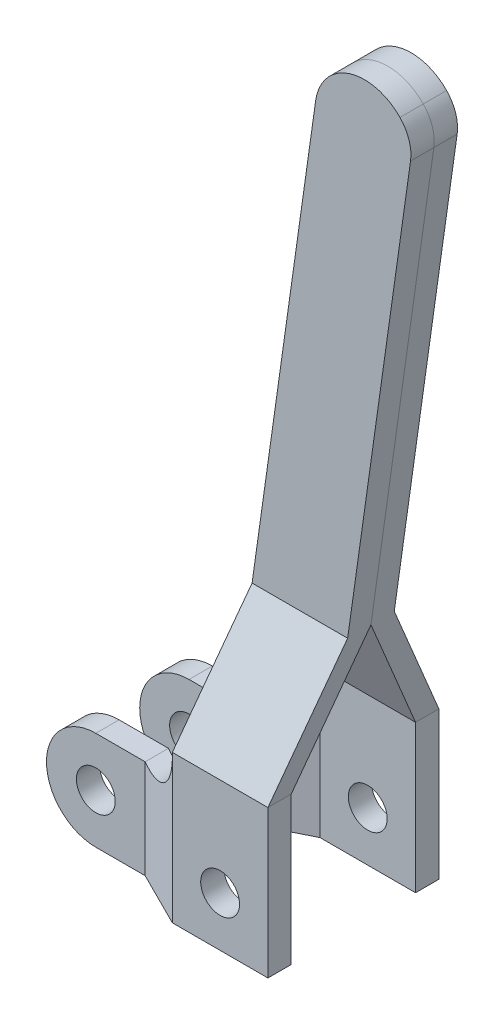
ISO-10303-21;
HEADER;
FILE_DESCRIPTION(('STEP AP214'),'2;1');
FILE_NAME('part.step','',(''),(''),'','','');
FILE_SCHEMA(('AUTOMOTIVE_DESIGN { 1 0 10303 214 1 1 1 1 }'));
ENDSEC;
DATA;
#1=APPLICATION_CONTEXT('core data for automotive mechanical design processes');
#2=APPLICATION_PROTOCOL_DEFINITION('international standard','automotive_design',2000,#1);
#3=PRODUCT_CONTEXT('',#1,'mechanical');
#4=PRODUCT('Part','Part','',(#3));
#5=PRODUCT_RELATED_PRODUCT_CATEGORY('part','',(#4));
#6=PRODUCT_DEFINITION_FORMATION('','',#4);
#7=PRODUCT_DEFINITION_CONTEXT('part definition',#1,'design');
#8=PRODUCT_DEFINITION('design','',#6,#7);
#9=PRODUCT_DEFINITION_SHAPE('','',#8);
#10=(LENGTH_UNIT() NAMED_UNIT(*) SI_UNIT(.MILLI.,.METRE.));
#11=(NAMED_UNIT(*) PLANE_ANGLE_UNIT() SI_UNIT($,.RADIAN.));
#12=(NAMED_UNIT(*) SI_UNIT($,.STERADIAN.) SOLID_ANGLE_UNIT());
#13=UNCERTAINTY_MEASURE_WITH_UNIT(LENGTH_MEASURE(1.E-05),#10,'distance_accuracy_value','');
#14=(GEOMETRIC_REPRESENTATION_CONTEXT(3) GLOBAL_UNCERTAINTY_ASSIGNED_CONTEXT((#13)) GLOBAL_UNIT_ASSIGNED_CONTEXT((#10,
#11,#12)) REPRESENTATION_CONTEXT('',''));
#15=CARTESIAN_POINT('',(0.,0.,0.));
#16=DIRECTION('',(0.,0.,1.));
#17=DIRECTION('',(1.,0.,0.));
#18=AXIS2_PLACEMENT_3D('',#15,#16,#17);
#19=CARTESIAN_POINT('',(-6.35,6.35,-12.));
#20=DIRECTION('',(0.,0.,1.));
#21=DIRECTION('',(-1.,0.,0.));
#22=AXIS2_PLACEMENT_3D('',#19,#20,#21);
#23=PLANE('',#22);
#24=CARTESIAN_POINT('',(-6.35,6.35,-12.));
#25=DIRECTION('',(0.,0.,1.));
#26=DIRECTION('',(-1.,0.,0.));
#27=AXIS2_PLACEMENT_3D('',#24,#25,#26);
#28=CIRCLE('',#27,6.35);
#29=CARTESIAN_POINT('',(-6.34999999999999,12.7,-12.));
#30=VERTEX_POINT('',#29);
#31=CARTESIAN_POINT('',(-6.35,0.,-12.));
#32=VERTEX_POINT('',#31);
#33=EDGE_CURVE('E349',#30,#32,#28,.T.);
#34=ORIENTED_EDGE('',*,*,#33,.F.);
#35=DIRECTION('',(-1.,0.,0.));
#36=VECTOR('',#35,1.);
#37=CARTESIAN_POINT('',(-6.34999999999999,12.7,-12.));
#38=LINE('',#37,#36);
#39=CARTESIAN_POINT('',(0.,12.7,-12.));
#40=VERTEX_POINT('',#39);
#41=EDGE_CURVE('E359',#40,#30,#38,.T.);
#42=ORIENTED_EDGE('',*,*,#41,.F.);
#43=DIRECTION('',(0.,1.,0.));
#44=VECTOR('',#43,1.);
#45=CARTESIAN_POINT('',(0.,12.7,-12.));
#46=LINE('',#45,#44);
#47=CARTESIAN_POINT('',(0.,0.,-12.));
#48=VERTEX_POINT('',#47);
#49=EDGE_CURVE('E356',#48,#40,#46,.T.);
#50=ORIENTED_EDGE('',*,*,#49,.F.);
#51=DIRECTION('',(1.,0.,0.));
#52=VECTOR('',#51,1.);
#53=CARTESIAN_POINT('',(0.,0.,-12.));
#54=LINE('',#53,#52);
#55=EDGE_CURVE('E352',#32,#48,#54,.T.);
#56=ORIENTED_EDGE('',*,*,#55,.F.);
#57=EDGE_LOOP('',(#34,#42,#50,#56));
#58=FACE_BOUND('',#57,.T.);
#59=CARTESIAN_POINT('',(-6.35,6.35,-12.));
#60=DIRECTION('',(0.,0.,1.));
#61=DIRECTION('',(1.,0.,0.));
#62=AXIS2_PLACEMENT_3D('',#59,#60,#61);
#63=CIRCLE('',#62,2.5);
#64=CARTESIAN_POINT('',(-3.85,6.35,-12.));
#65=VERTEX_POINT('',#64);
#66=EDGE_CURVE('E343',#65,#65,#63,.T.);
#67=ORIENTED_EDGE('',*,*,#66,.T.);
#68=EDGE_LOOP('',(#67));
#69=FACE_BOUND('',#68,.T.);
#70=ADVANCED_FACE('F52',(#58,#69),#23,.F.);
#71=CARTESIAN_POINT('',(-6.35,6.35,-9.));
#72=DIRECTION('',(0.,0.,1.));
#73=DIRECTION('',(-1.,0.,0.));
#74=AXIS2_PLACEMENT_3D('',#71,#72,#73);
#75=PLANE('',#74);
#76=CARTESIAN_POINT('',(-6.35,6.35,-9.));
#77=DIRECTION('',(0.,0.,1.));
#78=DIRECTION('',(-1.,0.,0.));
#79=AXIS2_PLACEMENT_3D('',#76,#77,#78);
#80=CIRCLE('',#79,6.35);
#81=CARTESIAN_POINT('',(-6.34999999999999,12.7,-9.));
#82=VERTEX_POINT('',#81);
#83=CARTESIAN_POINT('',(-6.35,0.,-9.));
#84=VERTEX_POINT('',#83);
#85=EDGE_CURVE('E346',#82,#84,#80,.T.);
#86=ORIENTED_EDGE('',*,*,#85,.T.);
#87=DIRECTION('',(1.,0.,0.));
#88=VECTOR('',#87,1.);
#89=CARTESIAN_POINT('',(0.,0.,-9.));
#90=LINE('',#89,#88);
#91=CARTESIAN_POINT('',(0.,0.,-9.));
#92=VERTEX_POINT('',#91);
#93=EDGE_CURVE('E365',#84,#92,#90,.T.);
#94=ORIENTED_EDGE('',*,*,#93,.T.);
#95=DIRECTION('',(0.,1.,0.));
#96=VECTOR('',#95,1.);
#97=CARTESIAN_POINT('',(0.,12.7,-9.));
#98=LINE('',#97,#96);
#99=CARTESIAN_POINT('',(0.,12.7,-9.));
#100=VERTEX_POINT('',#99);
#101=EDGE_CURVE('E368',#92,#100,#98,.T.);
#102=ORIENTED_EDGE('',*,*,#101,.T.);
#103=DIRECTION('',(-1.,0.,0.));
#104=VECTOR('',#103,1.);
#105=CARTESIAN_POINT('',(-6.34999999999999,12.7,-9.));
#106=LINE('',#105,#104);
#107=EDGE_CURVE('E353',#100,#82,#106,.T.);
#108=ORIENTED_EDGE('',*,*,#107,.T.);
#109=EDGE_LOOP('',(#86,#94,#102,#108));
#110=FACE_BOUND('',#109,.T.);
#111=CARTESIAN_POINT('',(-6.35,6.35,-9.));
#112=DIRECTION('',(0.,0.,1.));
#113=DIRECTION('',(1.,0.,0.));
#114=AXIS2_PLACEMENT_3D('',#111,#112,#113);
#115=CIRCLE('',#114,2.5);
#116=CARTESIAN_POINT('',(-3.85,6.35,-9.));
#117=VERTEX_POINT('',#116);
#118=EDGE_CURVE('E342',#117,#117,#115,.T.);
#119=ORIENTED_EDGE('',*,*,#118,.F.);
#120=EDGE_LOOP('',(#119));
#121=FACE_BOUND('',#120,.T.);
#122=ADVANCED_FACE('F403',(#110,#121),#75,.T.);
#123=CARTESIAN_POINT('',(-6.35,6.35,-12.));
#124=DIRECTION('',(0.,0.,1.));
#125=DIRECTION('',(-1.,0.,0.));
#126=AXIS2_PLACEMENT_3D('',#123,#124,#125);
#127=CYLINDRICAL_SURFACE('',#126,6.35);
#128=ORIENTED_EDGE('',*,*,#85,.F.);
#129=DIRECTION('',(0.,0.,1.));
#130=VECTOR('',#129,1.);
#131=CARTESIAN_POINT('',(-6.34999999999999,12.7,-12.));
#132=LINE('',#131,#130);
#133=EDGE_CURVE('E362',#30,#82,#132,.T.);
#134=ORIENTED_EDGE('',*,*,#133,.F.);
#135=ORIENTED_EDGE('',*,*,#33,.T.);
#136=DIRECTION('',(0.,0.,1.));
#137=VECTOR('',#136,1.);
#138=CARTESIAN_POINT('',(-6.35,0.,-12.));
#139=LINE('',#138,#137);
#140=EDGE_CURVE('E259',#32,#84,#139,.T.);
#141=ORIENTED_EDGE('',*,*,#140,.T.);
#142=EDGE_LOOP('',(#128,#134,#135,#141));
#143=FACE_BOUND('',#142,.T.);
#144=ADVANCED_FACE('F409',(#143),#127,.T.);
#145=CARTESIAN_POINT('',(0.,0.,-12.));
#146=DIRECTION('',(0.,1.,0.));
#147=DIRECTION('',(-1.,0.,0.));
#148=AXIS2_PLACEMENT_3D('',#145,#146,#147);
#149=PLANE('',#148);
#150=ORIENTED_EDGE('',*,*,#93,.F.);
#151=ORIENTED_EDGE('',*,*,#140,.F.);
#152=ORIENTED_EDGE('',*,*,#55,.T.);
#153=DIRECTION('',(0.894427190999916,0.,-0.447213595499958));
#154=VECTOR('',#153,1.);
#155=CARTESIAN_POINT('',(7.00000000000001,0.,-15.5));
#156=LINE('',#155,#154);
#157=CARTESIAN_POINT('',(7.,0.,-15.5));
#158=VERTEX_POINT('',#157);
#159=EDGE_CURVE('E330',#48,#158,#156,.T.);
#160=ORIENTED_EDGE('',*,*,#159,.T.);
#161=DIRECTION('',(1.,0.,0.));
#162=VECTOR('',#161,1.);
#163=CARTESIAN_POINT('',(19.3,0.,-15.5));
#164=LINE('',#163,#162);
#165=CARTESIAN_POINT('',(19.3,0.,-15.5));
#166=VERTEX_POINT('',#165);
#167=EDGE_CURVE('E267',#158,#166,#164,.T.);
#168=ORIENTED_EDGE('',*,*,#167,.T.);
#169=DIRECTION('',(0.,0.,-1.));
#170=VECTOR('',#169,1.);
#171=CARTESIAN_POINT('',(19.3,0.,-12.5));
#172=LINE('',#171,#170);
#173=CARTESIAN_POINT('',(19.3,0.,-12.5));
#174=VERTEX_POINT('',#173);
#175=EDGE_CURVE('E273',#174,#166,#172,.T.);
#176=ORIENTED_EDGE('',*,*,#175,.F.);
#177=DIRECTION('',(1.,0.,0.));
#178=VECTOR('',#177,1.);
#179=CARTESIAN_POINT('',(19.3,0.,-12.5));
#180=LINE('',#179,#178);
#181=CARTESIAN_POINT('',(7.00000000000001,0.,-12.5));
#182=VERTEX_POINT('',#181);
#183=EDGE_CURVE('E261',#182,#174,#180,.T.);
#184=ORIENTED_EDGE('',*,*,#183,.F.);
#185=DIRECTION('',(-0.894427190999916,0.,0.447213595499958));
#186=VECTOR('',#185,1.);
#187=CARTESIAN_POINT('',(0.,0.,-9.));
#188=LINE('',#187,#186);
#189=EDGE_CURVE('E332',#182,#92,#188,.T.);
#190=ORIENTED_EDGE('',*,*,#189,.T.);
#191=EDGE_LOOP('',(#150,#151,#152,#160,#168,#176,#184,#190));
#192=FACE_BOUND('',#191,.T.);
#193=ADVANCED_FACE('F421',(#192),#149,.F.);
#194=CARTESIAN_POINT('',(-6.34999999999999,12.7,-12.));
#195=DIRECTION('',(0.,-1.,0.));
#196=DIRECTION('',(1.,0.,0.));
#197=AXIS2_PLACEMENT_3D('',#194,#195,#196);
#198=PLANE('',#197);
#199=ORIENTED_EDGE('',*,*,#107,.F.);
#200=DIRECTION('',(0.,0.,1.));
#201=VECTOR('',#200,1.);
#202=CARTESIAN_POINT('',(0.,12.7,-12.));
#203=LINE('',#202,#201);
#204=EDGE_CURVE('E374',#40,#100,#203,.T.);
#205=ORIENTED_EDGE('',*,*,#204,.F.);
#206=ORIENTED_EDGE('',*,*,#41,.T.);
#207=ORIENTED_EDGE('',*,*,#133,.T.);
#208=EDGE_LOOP('',(#199,#205,#206,#207));
#209=FACE_BOUND('',#208,.T.);
#210=ADVANCED_FACE('F418',(#209),#198,.F.);
#211=CARTESIAN_POINT('',(-6.35,6.35,-12.));
#212=DIRECTION('',(0.,0.,1.));
#213=DIRECTION('',(-1.,0.,0.));
#214=AXIS2_PLACEMENT_3D('',#211,#212,#213);
#215=CYLINDRICAL_SURFACE('',#214,2.5);
#216=ORIENTED_EDGE('',*,*,#66,.F.);
#217=EDGE_LOOP('',(#216));
#218=FACE_BOUND('',#217,.T.);
#219=ORIENTED_EDGE('',*,*,#118,.T.);
#220=EDGE_LOOP('',(#219));
#221=FACE_BOUND('',#220,.T.);
#222=ADVANCED_FACE('F415',(#218,#221),#215,.F.);
#223=CARTESIAN_POINT('',(7.00000000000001,19.,-15.5));
#224=DIRECTION('',(0.447213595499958,0.,0.894427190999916));
#225=DIRECTION('',(-0.894427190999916,0.,0.447213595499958));
#226=AXIS2_PLACEMENT_3D('',#223,#224,#225);
#227=PLANE('',#226);
#228=DIRECTION('',(0.,-1.,0.));
#229=VECTOR('',#228,1.);
#230=CARTESIAN_POINT('',(7.00000000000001,19.,-15.5));
#231=LINE('',#230,#229);
#232=CARTESIAN_POINT('',(7.00000000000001,18.2279300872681,-15.5));
#233=VERTEX_POINT('',#232);
#234=EDGE_CURVE('E257',#233,#158,#231,.T.);
#235=ORIENTED_EDGE('',*,*,#234,.T.);
#236=ORIENTED_EDGE('',*,*,#159,.F.);
#237=ORIENTED_EDGE('',*,*,#49,.T.);
#238=CARTESIAN_POINT('',(1.01243146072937,18.613965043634,-12.5062157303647));
#239=DIRECTION('',(-0.447213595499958,0.,-0.894427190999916));
#240=DIRECTION('',(0.894427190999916,0.,-0.447213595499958));
#241=AXIS2_PLACEMENT_3D('',#238,#239,#240);
#242=ELLIPSE('',#241,6.70820393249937,6.);
#243=EDGE_CURVE('E379',#233,#40,#242,.T.);
#244=ORIENTED_EDGE('',*,*,#243,.F.);
#245=EDGE_LOOP('',(#235,#236,#237,#244));
#246=FACE_BOUND('',#245,.T.);
#247=ADVANCED_FACE('F442',(#246),#227,.F.);
#248=CARTESIAN_POINT('',(0.,19.,-9.));
#249=DIRECTION('',(-0.447213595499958,0.,-0.894427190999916));
#250=DIRECTION('',(0.894427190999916,0.,-0.447213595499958));
#251=AXIS2_PLACEMENT_3D('',#248,#249,#250);
#252=PLANE('',#251);
#253=ORIENTED_EDGE('',*,*,#101,.F.);
#254=ORIENTED_EDGE('',*,*,#189,.F.);
#255=DIRECTION('',(0.,-1.,0.));
#256=VECTOR('',#255,1.);
#257=CARTESIAN_POINT('',(7.00000000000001,19.,-12.5));
#258=LINE('',#257,#256);
#259=CARTESIAN_POINT('',(7.00000000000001,18.2279300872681,-12.5));
#260=VERTEX_POINT('',#259);
#261=EDGE_CURVE('E339',#260,#182,#258,.T.);
#262=ORIENTED_EDGE('',*,*,#261,.F.);
#263=CARTESIAN_POINT('',(1.01243146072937,18.613965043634,-9.50621573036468));
#264=DIRECTION('',(0.447213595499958,0.,0.894427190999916));
#265=DIRECTION('',(0.894427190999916,0.,-0.447213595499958));
#266=AXIS2_PLACEMENT_3D('',#263,#264,#265);
#267=ELLIPSE('',#266,6.70820393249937,6.);
#268=EDGE_CURVE('E378',#100,#260,#267,.T.);
#269=ORIENTED_EDGE('',*,*,#268,.F.);
#270=EDGE_LOOP('',(#253,#254,#262,#269));
#271=FACE_BOUND('',#270,.T.);
#272=ADVANCED_FACE('F440',(#271),#252,.F.);
#273=CARTESIAN_POINT('',(19.3,19.,-12.5));
#274=DIRECTION('',(1.,0.,0.));
#275=DIRECTION('',(0.,1.,0.));
#276=AXIS2_PLACEMENT_3D('',#273,#274,#275);
#277=PLANE('',#276);
#278=DIRECTION('',(0.,1.,0.));
#279=VECTOR('',#278,1.);
#280=CARTESIAN_POINT('',(19.3,19.,-15.5));
#281=LINE('',#280,#279);
#282=CARTESIAN_POINT('',(19.3,19.,-15.5));
#283=VERTEX_POINT('',#282);
#284=EDGE_CURVE('E262',#166,#283,#281,.T.);
#285=ORIENTED_EDGE('',*,*,#284,.T.);
#286=DIRECTION('',(0.,0.,-1.));
#287=VECTOR('',#286,1.);
#288=CARTESIAN_POINT('',(19.3,19.,-12.5));
#289=LINE('',#288,#287);
#290=CARTESIAN_POINT('',(19.3,19.,-12.5));
#291=VERTEX_POINT('',#290);
#292=EDGE_CURVE('E169',#291,#283,#289,.T.);
#293=ORIENTED_EDGE('',*,*,#292,.F.);
#294=DIRECTION('',(0.,1.,0.));
#295=VECTOR('',#294,1.);
#296=CARTESIAN_POINT('',(19.3,19.,-12.5));
#297=LINE('',#296,#295);
#298=EDGE_CURVE('E265',#174,#291,#297,.T.);
#299=ORIENTED_EDGE('',*,*,#298,.F.);
#300=ORIENTED_EDGE('',*,*,#175,.T.);
#301=EDGE_LOOP('',(#285,#293,#299,#300));
#302=FACE_BOUND('',#301,.T.);
#303=ADVANCED_FACE('F329',(#302),#277,.T.);
#304=CARTESIAN_POINT('',(0.,0.,-12.5));
#305=DIRECTION('',(0.,0.,1.));
#306=DIRECTION('',(-1.,0.,0.));
#307=AXIS2_PLACEMENT_3D('',#304,#305,#306);
#308=PLANE('',#307);
#309=CARTESIAN_POINT('',(1.01243146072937,18.613965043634,-12.5));
#310=DIRECTION('',(0.,0.,-1.));
#311=DIRECTION('',(-1.,0.,0.));
#312=AXIS2_PLACEMENT_3D('',#309,#310,#311);
#313=CIRCLE('',#312,6.);
#314=CARTESIAN_POINT('',(7.00000000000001,19.,-12.5));
#315=VERTEX_POINT('',#314);
#316=EDGE_CURVE('E232',#315,#260,#313,.T.);
#317=ORIENTED_EDGE('',*,*,#316,.T.);
#318=ORIENTED_EDGE('',*,*,#261,.T.);
#319=ORIENTED_EDGE('',*,*,#183,.T.);
#320=ORIENTED_EDGE('',*,*,#298,.T.);
#321=DIRECTION('',(1.,0.,0.));
#322=VECTOR('',#321,1.);
#323=CARTESIAN_POINT('',(0.,19.,-12.5));
#324=LINE('',#323,#322);
#325=EDGE_CURVE('E271',#291,#315,#324,.F.);
#326=ORIENTED_EDGE('',*,*,#325,.T.);
#327=EDGE_LOOP('',(#317,#318,#319,#320,#326));
#328=FACE_BOUND('',#327,.T.);
#329=CARTESIAN_POINT('',(13.15,6.4,-12.5));
#330=DIRECTION('',(0.,0.,1.));
#331=DIRECTION('',(1.,0.,0.));
#332=AXIS2_PLACEMENT_3D('',#329,#330,#331);
#333=CIRCLE('',#332,2.5);
#334=CARTESIAN_POINT('',(15.65,6.4,-12.5));
#335=VERTEX_POINT('',#334);
#336=EDGE_CURVE('E386',#335,#335,#333,.T.);
#337=ORIENTED_EDGE('',*,*,#336,.F.);
#338=EDGE_LOOP('',(#337));
#339=FACE_BOUND('',#338,.T.);
#340=ADVANCED_FACE('F322',(#328,#339),#308,.T.);
#341=CARTESIAN_POINT('',(0.,0.,-15.5));
#342=DIRECTION('',(0.,0.,1.));
#343=DIRECTION('',(-1.,0.,0.));
#344=AXIS2_PLACEMENT_3D('',#341,#342,#343);
#345=PLANE('',#344);
#346=CARTESIAN_POINT('',(13.15,6.4,-15.5));
#347=DIRECTION('',(0.,0.,1.));
#348=DIRECTION('',(1.,0.,0.));
#349=AXIS2_PLACEMENT_3D('',#346,#347,#348);
#350=CIRCLE('',#349,2.5);
#351=CARTESIAN_POINT('',(15.65,6.4,-15.5));
#352=VERTEX_POINT('',#351);
#353=EDGE_CURVE('E382',#352,#352,#350,.T.);
#354=ORIENTED_EDGE('',*,*,#353,.T.);
#355=EDGE_LOOP('',(#354));
#356=FACE_BOUND('',#355,.T.);
#357=DIRECTION('',(-1.,0.,0.));
#358=VECTOR('',#357,1.);
#359=CARTESIAN_POINT('',(0.,19.,-15.5));
#360=LINE('',#359,#358);
#361=CARTESIAN_POINT('',(7.00000000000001,19.,-15.5));
#362=VERTEX_POINT('',#361);
#363=EDGE_CURVE('E255',#283,#362,#360,.T.);
#364=ORIENTED_EDGE('',*,*,#363,.F.);
#365=ORIENTED_EDGE('',*,*,#284,.F.);
#366=ORIENTED_EDGE('',*,*,#167,.F.);
#367=ORIENTED_EDGE('',*,*,#234,.F.);
#368=CARTESIAN_POINT('',(1.01243146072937,18.613965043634,-15.5));
#369=DIRECTION('',(0.,0.,-1.));
#370=DIRECTION('',(-1.,0.,0.));
#371=AXIS2_PLACEMENT_3D('',#368,#369,#370);
#372=CIRCLE('',#371,6.);
#373=EDGE_CURVE('E249',#362,#233,#372,.T.);
#374=ORIENTED_EDGE('',*,*,#373,.F.);
#375=EDGE_LOOP('',(#364,#365,#366,#367,#374));
#376=FACE_BOUND('',#375,.T.);
#377=ADVANCED_FACE('F254',(#356,#376),#345,.F.);
#378=CARTESIAN_POINT('',(13.15,6.4,-12.5));
#379=DIRECTION('',(0.,0.,-1.));
#380=DIRECTION('',(1.,0.,0.));
#381=AXIS2_PLACEMENT_3D('',#378,#379,#380);
#382=CYLINDRICAL_SURFACE('',#381,2.5);
#383=ORIENTED_EDGE('',*,*,#336,.T.);
#384=EDGE_LOOP('',(#383));
#385=FACE_BOUND('',#384,.T.);
#386=ORIENTED_EDGE('',*,*,#353,.F.);
#387=EDGE_LOOP('',(#386));
#388=FACE_BOUND('',#387,.T.);
#389=ADVANCED_FACE('F393',(#385,#388),#382,.F.);
#390=CARTESIAN_POINT('',(1.01243146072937,18.613965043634,-9.));
#391=DIRECTION('',(0.,0.,-1.));
#392=DIRECTION('',(1.,0.,0.));
#393=AXIS2_PLACEMENT_3D('',#390,#391,#392);
#394=CYLINDRICAL_SURFACE('',#393,6.);
#395=ORIENTED_EDGE('',*,*,#373,.T.);
#396=ORIENTED_EDGE('',*,*,#243,.T.);
#397=ORIENTED_EDGE('',*,*,#204,.T.);
#398=ORIENTED_EDGE('',*,*,#268,.T.);
#399=ORIENTED_EDGE('',*,*,#316,.F.);
#400=DIRECTION('',(0.,0.,-1.));
#401=VECTOR('',#400,1.);
#402=CARTESIAN_POINT('',(7.00000000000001,19.,-9.));
#403=LINE('',#402,#401);
#404=EDGE_CURVE('E227',#315,#362,#403,.T.);
#405=ORIENTED_EDGE('',*,*,#404,.T.);
#406=EDGE_LOOP('',(#395,#396,#397,#398,#399,#405));
#407=FACE_BOUND('',#406,.T.);
#408=ADVANCED_FACE('F199',(#407),#394,.F.);
#409=CARTESIAN_POINT('',(0.,6.4,-21.8));
#410=DIRECTION('',(0.,0.447213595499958,-0.894427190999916));
#411=DIRECTION('',(0.,-0.894427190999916,-0.447213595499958));
#412=AXIS2_PLACEMENT_3D('',#409,#410,#411);
#413=PLANE('',#412);
#414=DIRECTION('',(-0.125474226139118,-0.887358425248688,-0.443679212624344));
#415=VECTOR('',#414,1.);
#416=CARTESIAN_POINT('',(9.26243146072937,35.,-7.5));
#417=LINE('',#416,#415);
#418=CARTESIAN_POINT('',(9.26243146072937,35.,-7.5));
#419=VERTEX_POINT('',#418);
#420=EDGE_CURVE('E175',#419,#362,#417,.T.);
#421=ORIENTED_EDGE('',*,*,#420,.F.);
#422=DIRECTION('',(1.,0.,0.));
#423=VECTOR('',#422,1.);
#424=CARTESIAN_POINT('',(21.5624314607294,35.,-7.5));
#425=LINE('',#424,#423);
#426=CARTESIAN_POINT('',(21.5624314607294,35.,-7.5));
#427=VERTEX_POINT('',#426);
#428=EDGE_CURVE('E156',#419,#427,#425,.T.);
#429=ORIENTED_EDGE('',*,*,#428,.T.);
#430=DIRECTION('',(-0.125474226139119,-0.887358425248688,-0.443679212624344));
#431=VECTOR('',#430,1.);
#432=CARTESIAN_POINT('',(21.5624314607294,35.,-7.5));
#433=LINE('',#432,#431);
#434=EDGE_CURVE('E165',#427,#283,#433,.T.);
#435=ORIENTED_EDGE('',*,*,#434,.T.);
#436=ORIENTED_EDGE('',*,*,#363,.T.);
#437=EDGE_LOOP('',(#421,#429,#435,#436));
#438=FACE_BOUND('',#437,.T.);
#439=ADVANCED_FACE('F178',(#438),#413,.T.);
#440=CARTESIAN_POINT('',(16.2876980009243,-2.30311252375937,-9.));
#441=DIRECTION('',(0.990150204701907,-0.140009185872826,0.));
#442=DIRECTION('',(0.140009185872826,0.990150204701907,0.));
#443=AXIS2_PLACEMENT_3D('',#440,#441,#442);
#444=PLANE('',#443);
#445=DIRECTION('',(0.140009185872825,0.990150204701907,0.));
#446=VECTOR('',#445,1.);
#447=CARTESIAN_POINT('',(21.5624314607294,35.,-4.5));
#448=LINE('',#447,#446);
#449=CARTESIAN_POINT('',(21.5624314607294,35.,-4.5));
#450=VERTEX_POINT('',#449);
#451=CARTESIAN_POINT('',(29.6561408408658,92.2390157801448,-4.5));
#452=VERTEX_POINT('',#451);
#453=EDGE_CURVE('E277',#450,#452,#448,.T.);
#454=ORIENTED_EDGE('',*,*,#453,.F.);
#455=DIRECTION('',(-0.125474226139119,-0.887358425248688,-0.443679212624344));
#456=VECTOR('',#455,1.);
#457=CARTESIAN_POINT('',(21.5624314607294,35.,-4.5));
#458=LINE('',#457,#456);
#459=EDGE_CURVE('E220',#450,#291,#458,.T.);
#460=ORIENTED_EDGE('',*,*,#459,.T.);
#461=ORIENTED_EDGE('',*,*,#292,.T.);
#462=ORIENTED_EDGE('',*,*,#434,.F.);
#463=DIRECTION('',(-0.140009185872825,-0.990150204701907,0.));
#464=VECTOR('',#463,1.);
#465=CARTESIAN_POINT('',(21.5624314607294,35.,-7.5));
#466=LINE('',#465,#464);
#467=CARTESIAN_POINT('',(29.6561408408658,92.2390157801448,-7.5));
#468=VERTEX_POINT('',#467);
#469=EDGE_CURVE('E151',#468,#427,#466,.T.);
#470=ORIENTED_EDGE('',*,*,#469,.F.);
#471=DIRECTION('',(0.,0.,-1.));
#472=VECTOR('',#471,1.);
#473=CARTESIAN_POINT('',(29.6561408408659,92.2390157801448,-9.));
#474=LINE('',#473,#472);
#475=EDGE_CURVE('E258',#452,#468,#474,.T.);
#476=ORIENTED_EDGE('',*,*,#475,.F.);
#477=EDGE_LOOP('',(#454,#460,#461,#462,#470,#476));
#478=FACE_BOUND('',#477,.T.);
#479=ADVANCED_FACE('F167',(#478),#444,.T.);
#480=CARTESIAN_POINT('',(4.22880963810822,-0.597961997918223,-9.));
#481=DIRECTION('',(-0.990150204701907,0.140009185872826,0.));
#482=DIRECTION('',(-0.140009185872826,-0.990150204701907,0.));
#483=AXIS2_PLACEMENT_3D('',#480,#481,#482);
#484=PLANE('',#483);
#485=DIRECTION('',(0.140009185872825,0.990150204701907,0.));
#486=VECTOR('',#485,1.);
#487=CARTESIAN_POINT('',(17.4480581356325,92.8890583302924,-7.5));
#488=LINE('',#487,#486);
#489=CARTESIAN_POINT('',(17.4480581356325,92.8890583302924,-7.5));
#490=VERTEX_POINT('',#489);
#491=EDGE_CURVE('E162',#419,#490,#488,.T.);
#492=ORIENTED_EDGE('',*,*,#491,.F.);
#493=ORIENTED_EDGE('',*,*,#420,.T.);
#494=ORIENTED_EDGE('',*,*,#404,.F.);
#495=DIRECTION('',(-0.125474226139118,-0.887358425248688,-0.443679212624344));
#496=VECTOR('',#495,1.);
#497=CARTESIAN_POINT('',(9.26243146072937,35.,-4.5));
#498=LINE('',#497,#496);
#499=CARTESIAN_POINT('',(9.26243146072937,35.,-4.5));
#500=VERTEX_POINT('',#499);
#501=EDGE_CURVE('E174',#500,#315,#498,.T.);
#502=ORIENTED_EDGE('',*,*,#501,.F.);
#503=DIRECTION('',(-0.140009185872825,-0.990150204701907,0.));
#504=VECTOR('',#503,1.);
#505=CARTESIAN_POINT('',(17.4480581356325,92.8890583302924,-4.5));
#506=LINE('',#505,#504);
#507=CARTESIAN_POINT('',(17.4480581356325,92.8890583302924,-4.5));
#508=VERTEX_POINT('',#507);
#509=EDGE_CURVE('E274',#508,#500,#506,.T.);
#510=ORIENTED_EDGE('',*,*,#509,.F.);
#511=DIRECTION('',(0.,0.,-1.));
#512=VECTOR('',#511,1.);
#513=CARTESIAN_POINT('',(17.4480581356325,92.8890583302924,-4.5));
#514=LINE('',#513,#512);
#515=EDGE_CURVE('E239',#508,#490,#514,.T.);
#516=ORIENTED_EDGE('',*,*,#515,.T.);
#517=EDGE_LOOP('',(#492,#493,#494,#502,#510,#516));
#518=FACE_BOUND('',#517,.T.);
#519=ADVANCED_FACE('F204',(#518),#484,.T.);
#520=CARTESIAN_POINT('',(0.,5.2,-19.4));
#521=DIRECTION('',(0.,-0.447213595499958,0.894427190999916));
#522=DIRECTION('',(0.,0.894427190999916,0.447213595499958));
#523=AXIS2_PLACEMENT_3D('',#520,#521,#522);
#524=PLANE('',#523);
#525=ORIENTED_EDGE('',*,*,#459,.F.);
#526=DIRECTION('',(-1.,0.,0.));
#527=VECTOR('',#526,1.);
#528=CARTESIAN_POINT('',(9.26243146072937,35.,-4.5));
#529=LINE('',#528,#527);
#530=EDGE_CURVE('E179',#450,#500,#529,.T.);
#531=ORIENTED_EDGE('',*,*,#530,.T.);
#532=ORIENTED_EDGE('',*,*,#501,.T.);
#533=ORIENTED_EDGE('',*,*,#325,.F.);
#534=EDGE_LOOP('',(#525,#531,#532,#533));
#535=FACE_BOUND('',#534,.T.);
#536=ADVANCED_FACE('F207',(#535),#524,.T.);
#537=CARTESIAN_POINT('',(23.7355119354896,92.,-4.5));
#538=DIRECTION('',(0.,0.,-1.));
#539=DIRECTION('',(1.,0.,0.));
#540=AXIS2_PLACEMENT_3D('',#537,#538,#539);
#541=CYLINDRICAL_SURFACE('',#540,6.35);
#542=CARTESIAN_POINT('',(23.7355119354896,92.,-7.5));
#543=DIRECTION('',(0.,0.,-1.));
#544=DIRECTION('',(-1.,0.,0.));
#545=AXIS2_PLACEMENT_3D('',#542,#543,#544);
#546=CIRCLE('',#545,6.35);
#547=CARTESIAN_POINT('',(28.2975301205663,96.4170680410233,-7.5));
#548=VERTEX_POINT('',#547);
#549=EDGE_CURVE('E278',#490,#548,#546,.T.);
#550=ORIENTED_EDGE('',*,*,#549,.F.);
#551=ORIENTED_EDGE('',*,*,#515,.F.);
#552=CARTESIAN_POINT('',(23.7355119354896,92.,-4.5));
#553=DIRECTION('',(0.,0.,1.));
#554=DIRECTION('',(-1.,0.,0.));
#555=AXIS2_PLACEMENT_3D('',#552,#553,#554);
#556=CIRCLE('',#555,6.35);
#557=CARTESIAN_POINT('',(28.2975301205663,96.4170680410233,-4.5));
#558=VERTEX_POINT('',#557);
#559=EDGE_CURVE('E313',#558,#508,#556,.T.);
#560=ORIENTED_EDGE('',*,*,#559,.F.);
#561=DIRECTION('',(0.,0.,-1.));
#562=VECTOR('',#561,1.);
#563=CARTESIAN_POINT('',(28.2975301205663,96.4170680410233,-4.5));
#564=LINE('',#563,#562);
#565=EDGE_CURVE('E60',#548,#558,#564,.F.);
#566=ORIENTED_EDGE('',*,*,#565,.F.);
#567=EDGE_LOOP('',(#550,#551,#560,#566));
#568=FACE_BOUND('',#567,.T.);
#569=ADVANCED_FACE('F200',(#568),#541,.T.);
#570=CARTESIAN_POINT('',(23.7355119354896,92.,-4.5));
#571=DIRECTION('',(0.,0.,1.));
#572=DIRECTION('',(-1.,0.,0.));
#573=AXIS2_PLACEMENT_3D('',#570,#571,#572);
#574=PLANE('',#573);
#575=ORIENTED_EDGE('',*,*,#559,.T.);
#576=ORIENTED_EDGE('',*,*,#509,.T.);
#577=ORIENTED_EDGE('',*,*,#530,.F.);
#578=ORIENTED_EDGE('',*,*,#453,.T.);
#579=CARTESIAN_POINT('',(24.7053898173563,92.9390617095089,-4.5));
#580=DIRECTION('',(0.,0.,-1.));
#581=DIRECTION('',(-1.,0.,0.));
#582=AXIS2_PLACEMENT_3D('',#579,#580,#581);
#583=CIRCLE('',#582,5.);
#584=EDGE_CURVE('E13',#558,#452,#583,.T.);
#585=ORIENTED_EDGE('',*,*,#584,.F.);
#586=EDGE_LOOP('',(#575,#576,#577,#578,#585));
#587=FACE_BOUND('',#586,.T.);
#588=ADVANCED_FACE('F286',(#587),#574,.T.);
#589=CARTESIAN_POINT('',(23.7355119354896,92.,-7.5));
#590=DIRECTION('',(0.,0.,1.));
#591=DIRECTION('',(-1.,0.,0.));
#592=AXIS2_PLACEMENT_3D('',#589,#590,#591);
#593=PLANE('',#592);
#594=ORIENTED_EDGE('',*,*,#469,.T.);
#595=ORIENTED_EDGE('',*,*,#428,.F.);
#596=ORIENTED_EDGE('',*,*,#491,.T.);
#597=ORIENTED_EDGE('',*,*,#549,.T.);
#598=CARTESIAN_POINT('',(24.7053898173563,92.9390617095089,-7.5));
#599=DIRECTION('',(0.,0.,-1.));
#600=DIRECTION('',(-1.,0.,0.));
#601=AXIS2_PLACEMENT_3D('',#598,#599,#600);
#602=CIRCLE('',#601,5.);
#603=EDGE_CURVE('E72',#468,#548,#602,.F.);
#604=ORIENTED_EDGE('',*,*,#603,.F.);
#605=EDGE_LOOP('',(#594,#595,#596,#597,#604));
#606=FACE_BOUND('',#605,.T.);
#607=ADVANCED_FACE('F153',(#606),#593,.F.);
#608=CARTESIAN_POINT('',(24.7053898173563,92.9390617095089,-4.5));
#609=DIRECTION('',(0.,0.,-1.));
#610=DIRECTION('',(1.,0.,0.));
#611=AXIS2_PLACEMENT_3D('',#608,#609,#610);
#612=CYLINDRICAL_SURFACE('',#611,5.);
#613=ORIENTED_EDGE('',*,*,#584,.T.);
#614=ORIENTED_EDGE('',*,*,#475,.T.);
#615=ORIENTED_EDGE('',*,*,#603,.T.);
#616=ORIENTED_EDGE('',*,*,#565,.T.);
#617=EDGE_LOOP('',(#613,#614,#615,#616));
#618=FACE_BOUND('',#617,.T.);
#619=ADVANCED_FACE('F54',(#618),#612,.T.);
#620=CLOSED_SHELL('',(#70,#122,#144,#193,#210,#222,#247,#272,#303,#340,#377,#389,#408,#439,#479,
#519,#536,#569,#588,#607,#619));
#621=MANIFOLD_SOLID_BREP('B2',#620);
#622=CARTESIAN_POINT('',(-6.35,6.35,3.));
#623=DIRECTION('',(0.,0.,-1.));
#624=DIRECTION('',(-1.,0.,0.));
#625=AXIS2_PLACEMENT_3D('',#622,#623,#624);
#626=PLANE('',#625);
#627=CARTESIAN_POINT('',(-6.35,6.35,3.));
#628=DIRECTION('',(0.,0.,1.));
#629=DIRECTION('',(-1.,0.,0.));
#630=AXIS2_PLACEMENT_3D('',#627,#628,#629);
#631=CIRCLE('',#630,6.35);
#632=CARTESIAN_POINT('',(-6.34999999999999,12.7,3.));
#633=VERTEX_POINT('',#632);
#634=CARTESIAN_POINT('',(-6.35,0.,3.));
#635=VERTEX_POINT('',#634);
#636=EDGE_CURVE('E864',#633,#635,#631,.T.);
#637=ORIENTED_EDGE('',*,*,#636,.T.);
#638=DIRECTION('',(1.,0.,0.));
#639=VECTOR('',#638,1.);
#640=CARTESIAN_POINT('',(0.,0.,3.));
#641=LINE('',#640,#639);
#642=CARTESIAN_POINT('',(0.,0.,3.));
#643=VERTEX_POINT('',#642);
#644=EDGE_CURVE('E867',#635,#643,#641,.T.);
#645=ORIENTED_EDGE('',*,*,#644,.T.);
#646=DIRECTION('',(0.,1.,0.));
#647=VECTOR('',#646,1.);
#648=CARTESIAN_POINT('',(0.,12.7,3.));
#649=LINE('',#648,#647);
#650=CARTESIAN_POINT('',(0.,12.7,3.));
#651=VERTEX_POINT('',#650);
#652=EDGE_CURVE('E871',#643,#651,#649,.T.);
#653=ORIENTED_EDGE('',*,*,#652,.T.);
#654=DIRECTION('',(-1.,0.,0.));
#655=VECTOR('',#654,1.);
#656=CARTESIAN_POINT('',(-6.34999999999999,12.7,3.));
#657=LINE('',#656,#655);
#658=EDGE_CURVE('E874',#651,#633,#657,.T.);
#659=ORIENTED_EDGE('',*,*,#658,.T.);
#660=EDGE_LOOP('',(#637,#645,#653,#659));
#661=FACE_BOUND('',#660,.T.);
#662=CARTESIAN_POINT('',(-6.35,6.35,3.));
#663=DIRECTION('',(0.,0.,1.));
#664=DIRECTION('',(1.,0.,0.));
#665=AXIS2_PLACEMENT_3D('',#662,#663,#664);
#666=CIRCLE('',#665,2.5);
#667=CARTESIAN_POINT('',(-3.85,6.35,3.));
#668=VERTEX_POINT('',#667);
#669=EDGE_CURVE('E858',#668,#668,#666,.T.);
#670=ORIENTED_EDGE('',*,*,#669,.F.);
#671=EDGE_LOOP('',(#670));
#672=FACE_BOUND('',#671,.T.);
#673=ADVANCED_FACE('F591',(#661,#672),#626,.F.);
#674=CARTESIAN_POINT('',(-6.35,6.35,0.));
#675=DIRECTION('',(0.,0.,-1.));
#676=DIRECTION('',(-1.,0.,0.));
#677=AXIS2_PLACEMENT_3D('',#674,#675,#676);
#678=PLANE('',#677);
#679=CARTESIAN_POINT('',(-6.35,6.35,0.));
#680=DIRECTION('',(0.,0.,1.));
#681=DIRECTION('',(-1.,0.,0.));
#682=AXIS2_PLACEMENT_3D('',#679,#680,#681);
#683=CIRCLE('',#682,6.35);
#684=CARTESIAN_POINT('',(-6.34999999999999,12.7,0.));
#685=VERTEX_POINT('',#684);
#686=CARTESIAN_POINT('',(-6.35,0.,0.));
#687=VERTEX_POINT('',#686);
#688=EDGE_CURVE('E861',#685,#687,#683,.T.);
#689=ORIENTED_EDGE('',*,*,#688,.F.);
#690=DIRECTION('',(-1.,0.,0.));
#691=VECTOR('',#690,1.);
#692=CARTESIAN_POINT('',(-6.34999999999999,12.7,0.));
#693=LINE('',#692,#691);
#694=CARTESIAN_POINT('',(0.,12.7,0.));
#695=VERTEX_POINT('',#694);
#696=EDGE_CURVE('E868',#695,#685,#693,.T.);
#697=ORIENTED_EDGE('',*,*,#696,.F.);
#698=DIRECTION('',(0.,1.,0.));
#699=VECTOR('',#698,1.);
#700=CARTESIAN_POINT('',(0.,12.7,0.));
#701=LINE('',#700,#699);
#702=CARTESIAN_POINT('',(0.,0.,0.));
#703=VERTEX_POINT('',#702);
#704=EDGE_CURVE('E882',#703,#695,#701,.T.);
#705=ORIENTED_EDGE('',*,*,#704,.F.);
#706=DIRECTION('',(1.,0.,0.));
#707=VECTOR('',#706,1.);
#708=CARTESIAN_POINT('',(0.,0.,0.));
#709=LINE('',#708,#707);
#710=EDGE_CURVE('E879',#687,#703,#709,.T.);
#711=ORIENTED_EDGE('',*,*,#710,.F.);
#712=EDGE_LOOP('',(#689,#697,#705,#711));
#713=FACE_BOUND('',#712,.T.);
#714=CARTESIAN_POINT('',(-6.35,6.35,0.));
#715=DIRECTION('',(0.,0.,1.));
#716=DIRECTION('',(1.,0.,0.));
#717=AXIS2_PLACEMENT_3D('',#714,#715,#716);
#718=CIRCLE('',#717,2.5);
#719=CARTESIAN_POINT('',(-3.85,6.35,0.));
#720=VERTEX_POINT('',#719);
#721=EDGE_CURVE('E857',#720,#720,#718,.T.);
#722=ORIENTED_EDGE('',*,*,#721,.T.);
#723=EDGE_LOOP('',(#722));
#724=FACE_BOUND('',#723,.T.);
#725=ADVANCED_FACE('F930',(#713,#724),#678,.T.);
#726=CARTESIAN_POINT('',(-6.35,6.35,3.));
#727=DIRECTION('',(0.,0.,-1.));
#728=DIRECTION('',(-1.,0.,0.));
#729=AXIS2_PLACEMENT_3D('',#726,#727,#728);
#730=CYLINDRICAL_SURFACE('',#729,6.35);
#731=ORIENTED_EDGE('',*,*,#688,.T.);
#732=DIRECTION('',(0.,0.,-1.));
#733=VECTOR('',#732,1.);
#734=CARTESIAN_POINT('',(-6.35,0.,3.));
#735=LINE('',#734,#733);
#736=EDGE_CURVE('E826',#635,#687,#735,.T.);
#737=ORIENTED_EDGE('',*,*,#736,.F.);
#738=ORIENTED_EDGE('',*,*,#636,.F.);
#739=DIRECTION('',(0.,0.,-1.));
#740=VECTOR('',#739,1.);
#741=CARTESIAN_POINT('',(-6.34999999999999,12.7,3.));
#742=LINE('',#741,#740);
#743=EDGE_CURVE('E876',#633,#685,#742,.T.);
#744=ORIENTED_EDGE('',*,*,#743,.T.);
#745=EDGE_LOOP('',(#731,#737,#738,#744));
#746=FACE_BOUND('',#745,.T.);
#747=ADVANCED_FACE('F936',(#746),#730,.T.);
#748=CARTESIAN_POINT('',(0.,0.,3.));
#749=DIRECTION('',(0.,1.,0.));
#750=DIRECTION('',(-1.,0.,0.));
#751=AXIS2_PLACEMENT_3D('',#748,#749,#750);
#752=PLANE('',#751);
#753=ORIENTED_EDGE('',*,*,#710,.T.);
#754=DIRECTION('',(-0.894427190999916,0.,-0.447213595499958));
#755=VECTOR('',#754,1.);
#756=CARTESIAN_POINT('',(0.,0.,0.));
#757=LINE('',#756,#755);
#758=CARTESIAN_POINT('',(7.00000000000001,0.,3.5));
#759=VERTEX_POINT('',#758);
#760=EDGE_CURVE('E842',#759,#703,#757,.T.);
#761=ORIENTED_EDGE('',*,*,#760,.F.);
#762=DIRECTION('',(1.,0.,0.));
#763=VECTOR('',#762,1.);
#764=CARTESIAN_POINT('',(19.3,0.,3.5));
#765=LINE('',#764,#763);
#766=CARTESIAN_POINT('',(19.3,0.,3.5));
#767=VERTEX_POINT('',#766);
#768=EDGE_CURVE('E891',#759,#767,#765,.T.);
#769=ORIENTED_EDGE('',*,*,#768,.T.);
#770=DIRECTION('',(0.,0.,1.));
#771=VECTOR('',#770,1.);
#772=CARTESIAN_POINT('',(19.3,0.,3.5));
#773=LINE('',#772,#771);
#774=CARTESIAN_POINT('',(19.3,0.,6.5));
#775=VERTEX_POINT('',#774);
#776=EDGE_CURVE('E784',#767,#775,#773,.T.);
#777=ORIENTED_EDGE('',*,*,#776,.T.);
#778=DIRECTION('',(1.,0.,0.));
#779=VECTOR('',#778,1.);
#780=CARTESIAN_POINT('',(19.3,0.,6.5));
#781=LINE('',#780,#779);
#782=CARTESIAN_POINT('',(7.,0.,6.5));
#783=VERTEX_POINT('',#782);
#784=EDGE_CURVE('E849',#783,#775,#781,.T.);
#785=ORIENTED_EDGE('',*,*,#784,.F.);
#786=DIRECTION('',(0.894427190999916,0.,0.447213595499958));
#787=VECTOR('',#786,1.);
#788=CARTESIAN_POINT('',(7.00000000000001,0.,6.5));
#789=LINE('',#788,#787);
#790=EDGE_CURVE('E836',#643,#783,#789,.T.);
#791=ORIENTED_EDGE('',*,*,#790,.F.);
#792=ORIENTED_EDGE('',*,*,#644,.F.);
#793=ORIENTED_EDGE('',*,*,#736,.T.);
#794=EDGE_LOOP('',(#753,#761,#769,#777,#785,#791,#792,#793));
#795=FACE_BOUND('',#794,.T.);
#796=ADVANCED_FACE('F947',(#795),#752,.F.);
#797=CARTESIAN_POINT('',(-6.34999999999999,12.7,3.));
#798=DIRECTION('',(0.,-1.,0.));
#799=DIRECTION('',(1.,0.,0.));
#800=AXIS2_PLACEMENT_3D('',#797,#798,#799);
#801=PLANE('',#800);
#802=ORIENTED_EDGE('',*,*,#696,.T.);
#803=ORIENTED_EDGE('',*,*,#743,.F.);
#804=ORIENTED_EDGE('',*,*,#658,.F.);
#805=DIRECTION('',(0.,0.,-1.));
#806=VECTOR('',#805,1.);
#807=CARTESIAN_POINT('',(0.,12.7,3.));
#808=LINE('',#807,#806);
#809=EDGE_CURVE('E832',#651,#695,#808,.T.);
#810=ORIENTED_EDGE('',*,*,#809,.T.);
#811=EDGE_LOOP('',(#802,#803,#804,#810));
#812=FACE_BOUND('',#811,.T.);
#813=ADVANCED_FACE('F944',(#812),#801,.F.);
#814=CARTESIAN_POINT('',(-6.35,6.35,3.));
#815=DIRECTION('',(0.,0.,-1.));
#816=DIRECTION('',(-1.,0.,0.));
#817=AXIS2_PLACEMENT_3D('',#814,#815,#816);
#818=CYLINDRICAL_SURFACE('',#817,2.5);
#819=ORIENTED_EDGE('',*,*,#669,.T.);
#820=EDGE_LOOP('',(#819));
#821=FACE_BOUND('',#820,.T.);
#822=ORIENTED_EDGE('',*,*,#721,.F.);
#823=EDGE_LOOP('',(#822));
#824=FACE_BOUND('',#823,.T.);
#825=ADVANCED_FACE('F941',(#821,#824),#818,.F.);
#826=CARTESIAN_POINT('',(7.00000000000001,19.,6.5));
#827=DIRECTION('',(0.447213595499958,0.,-0.894427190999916));
#828=DIRECTION('',(-0.894427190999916,0.,-0.447213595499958));
#829=AXIS2_PLACEMENT_3D('',#826,#827,#828);
#830=PLANE('',#829);
#831=DIRECTION('',(0.,-1.,0.));
#832=VECTOR('',#831,1.);
#833=CARTESIAN_POINT('',(7.00000000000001,19.,6.5));
#834=LINE('',#833,#832);
#835=CARTESIAN_POINT('',(7.00000000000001,18.2279300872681,6.5));
#836=VERTEX_POINT('',#835);
#837=EDGE_CURVE('E855',#836,#783,#834,.T.);
#838=ORIENTED_EDGE('',*,*,#837,.F.);
#839=CARTESIAN_POINT('',(1.01243146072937,18.613965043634,3.50621573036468));
#840=DIRECTION('',(0.447213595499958,0.,-0.894427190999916));
#841=DIRECTION('',(0.894427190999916,0.,0.447213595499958));
#842=AXIS2_PLACEMENT_3D('',#839,#840,#841);
#843=ELLIPSE('',#842,6.70820393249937,6.);
#844=EDGE_CURVE('E900',#836,#651,#843,.T.);
#845=ORIENTED_EDGE('',*,*,#844,.T.);
#846=ORIENTED_EDGE('',*,*,#652,.F.);
#847=ORIENTED_EDGE('',*,*,#790,.T.);
#848=EDGE_LOOP('',(#838,#845,#846,#847));
#849=FACE_BOUND('',#848,.T.);
#850=ADVANCED_FACE('F926',(#849),#830,.F.);
#851=CARTESIAN_POINT('',(0.,19.,0.));
#852=DIRECTION('',(-0.447213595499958,0.,0.894427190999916));
#853=DIRECTION('',(0.894427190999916,0.,0.447213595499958));
#854=AXIS2_PLACEMENT_3D('',#851,#852,#853);
#855=PLANE('',#854);
#856=ORIENTED_EDGE('',*,*,#704,.T.);
#857=CARTESIAN_POINT('',(1.01243146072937,18.613965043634,0.506215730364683));
#858=DIRECTION('',(-0.447213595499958,0.,0.894427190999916));
#859=DIRECTION('',(0.894427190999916,0.,0.447213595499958));
#860=AXIS2_PLACEMENT_3D('',#857,#858,#859);
#861=ELLIPSE('',#860,6.70820393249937,6.);
#862=CARTESIAN_POINT('',(7.00000000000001,18.2279300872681,3.5));
#863=VERTEX_POINT('',#862);
#864=EDGE_CURVE('E777',#695,#863,#861,.T.);
#865=ORIENTED_EDGE('',*,*,#864,.T.);
#866=DIRECTION('',(0.,-1.,0.));
#867=VECTOR('',#866,1.);
#868=CARTESIAN_POINT('',(7.00000000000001,19.,3.5));
#869=LINE('',#868,#867);
#870=EDGE_CURVE('E853',#863,#759,#869,.T.);
#871=ORIENTED_EDGE('',*,*,#870,.T.);
#872=ORIENTED_EDGE('',*,*,#760,.T.);
#873=EDGE_LOOP('',(#856,#865,#871,#872));
#874=FACE_BOUND('',#873,.T.);
#875=ADVANCED_FACE('F909',(#874),#855,.F.);
#876=CARTESIAN_POINT('',(19.3,19.,3.5));
#877=DIRECTION('',(1.,0.,0.));
#878=DIRECTION('',(0.,1.,0.));
#879=AXIS2_PLACEMENT_3D('',#876,#877,#878);
#880=PLANE('',#879);
#881=DIRECTION('',(0.,1.,0.));
#882=VECTOR('',#881,1.);
#883=CARTESIAN_POINT('',(19.3,19.,6.5));
#884=LINE('',#883,#882);
#885=CARTESIAN_POINT('',(19.3,19.,6.5));
#886=VERTEX_POINT('',#885);
#887=EDGE_CURVE('E890',#775,#886,#884,.T.);
#888=ORIENTED_EDGE('',*,*,#887,.F.);
#889=ORIENTED_EDGE('',*,*,#776,.F.);
#890=DIRECTION('',(0.,1.,0.));
#891=VECTOR('',#890,1.);
#892=CARTESIAN_POINT('',(19.3,19.,3.5));
#893=LINE('',#892,#891);
#894=CARTESIAN_POINT('',(19.3,19.,3.5));
#895=VERTEX_POINT('',#894);
#896=EDGE_CURVE('E785',#767,#895,#893,.T.);
#897=ORIENTED_EDGE('',*,*,#896,.T.);
#898=DIRECTION('',(0.,0.,1.));
#899=VECTOR('',#898,1.);
#900=CARTESIAN_POINT('',(19.3,19.,3.5));
#901=LINE('',#900,#899);
#902=EDGE_CURVE('E835',#895,#886,#901,.T.);
#903=ORIENTED_EDGE('',*,*,#902,.T.);
#904=EDGE_LOOP('',(#888,#889,#897,#903));
#905=FACE_BOUND('',#904,.T.);
#906=ADVANCED_FACE('F918',(#905),#880,.T.);
#907=CARTESIAN_POINT('',(0.,0.,3.5));
#908=DIRECTION('',(0.,0.,-1.));
#909=DIRECTION('',(-1.,0.,0.));
#910=AXIS2_PLACEMENT_3D('',#907,#908,#909);
#911=PLANE('',#910);
#912=CARTESIAN_POINT('',(1.01243146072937,18.613965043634,3.5));
#913=DIRECTION('',(0.,0.,-1.));
#914=DIRECTION('',(-1.,0.,0.));
#915=AXIS2_PLACEMENT_3D('',#912,#913,#914);
#916=CIRCLE('',#915,6.);
#917=CARTESIAN_POINT('',(7.00000000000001,19.,3.5));
#918=VERTEX_POINT('',#917);
#919=EDGE_CURVE('E774',#918,#863,#916,.T.);
#920=ORIENTED_EDGE('',*,*,#919,.F.);
#921=DIRECTION('',(1.,0.,0.));
#922=VECTOR('',#921,1.);
#923=CARTESIAN_POINT('',(0.,19.,3.5));
#924=LINE('',#923,#922);
#925=EDGE_CURVE('E782',#895,#918,#924,.F.);
#926=ORIENTED_EDGE('',*,*,#925,.F.);
#927=ORIENTED_EDGE('',*,*,#896,.F.);
#928=ORIENTED_EDGE('',*,*,#768,.F.);
#929=ORIENTED_EDGE('',*,*,#870,.F.);
#930=EDGE_LOOP('',(#920,#926,#927,#928,#929));
#931=FACE_BOUND('',#930,.T.);
#932=CARTESIAN_POINT('',(13.15,6.4,3.5));
#933=DIRECTION('',(0.,0.,1.));
#934=DIRECTION('',(1.,0.,0.));
#935=AXIS2_PLACEMENT_3D('',#932,#933,#934);
#936=CIRCLE('',#935,2.5);
#937=CARTESIAN_POINT('',(15.65,6.4,3.5));
#938=VERTEX_POINT('',#937);
#939=EDGE_CURVE('E899',#938,#938,#936,.T.);
#940=ORIENTED_EDGE('',*,*,#939,.T.);
#941=EDGE_LOOP('',(#940));
#942=FACE_BOUND('',#941,.T.);
#943=ADVANCED_FACE('F914',(#931,#942),#911,.T.);
#944=CARTESIAN_POINT('',(0.,0.,6.5));
#945=DIRECTION('',(0.,0.,-1.));
#946=DIRECTION('',(-1.,0.,0.));
#947=AXIS2_PLACEMENT_3D('',#944,#945,#946);
#948=PLANE('',#947);
#949=CARTESIAN_POINT('',(13.15,6.4,6.5));
#950=DIRECTION('',(0.,0.,1.));
#951=DIRECTION('',(1.,0.,0.));
#952=AXIS2_PLACEMENT_3D('',#949,#950,#951);
#953=CIRCLE('',#952,2.5);
#954=CARTESIAN_POINT('',(15.65,6.4,6.5));
#955=VERTEX_POINT('',#954);
#956=EDGE_CURVE('E896',#955,#955,#953,.T.);
#957=ORIENTED_EDGE('',*,*,#956,.F.);
#958=EDGE_LOOP('',(#957));
#959=FACE_BOUND('',#958,.T.);
#960=DIRECTION('',(-1.,0.,0.));
#961=VECTOR('',#960,1.);
#962=CARTESIAN_POINT('',(0.,19.,6.5));
#963=LINE('',#962,#961);
#964=CARTESIAN_POINT('',(7.00000000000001,19.,6.5));
#965=VERTEX_POINT('',#964);
#966=EDGE_CURVE('E716',#886,#965,#963,.T.);
#967=ORIENTED_EDGE('',*,*,#966,.T.);
#968=CARTESIAN_POINT('',(1.01243146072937,18.613965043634,6.5));
#969=DIRECTION('',(0.,0.,-1.));
#970=DIRECTION('',(-1.,0.,0.));
#971=AXIS2_PLACEMENT_3D('',#968,#969,#970);
#972=CIRCLE('',#971,6.);
#973=EDGE_CURVE('E824',#965,#836,#972,.T.);
#974=ORIENTED_EDGE('',*,*,#973,.T.);
#975=ORIENTED_EDGE('',*,*,#837,.T.);
#976=ORIENTED_EDGE('',*,*,#784,.T.);
#977=ORIENTED_EDGE('',*,*,#887,.T.);
#978=EDGE_LOOP('',(#967,#974,#975,#976,#977));
#979=FACE_BOUND('',#978,.T.);
#980=ADVANCED_FACE('F916',(#959,#979),#948,.F.);
#981=CARTESIAN_POINT('',(13.15,6.4,3.5));
#982=DIRECTION('',(0.,0.,1.));
#983=DIRECTION('',(1.,0.,0.));
#984=AXIS2_PLACEMENT_3D('',#981,#982,#983);
#985=CYLINDRICAL_SURFACE('',#984,2.5);
#986=ORIENTED_EDGE('',*,*,#939,.F.);
#987=EDGE_LOOP('',(#986));
#988=FACE_BOUND('',#987,.T.);
#989=ORIENTED_EDGE('',*,*,#956,.T.);
#990=EDGE_LOOP('',(#989));
#991=FACE_BOUND('',#990,.T.);
#992=ADVANCED_FACE('F989',(#988,#991),#985,.F.);
#993=CARTESIAN_POINT('',(1.01243146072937,18.613965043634,0.));
#994=DIRECTION('',(0.,0.,1.));
#995=DIRECTION('',(1.,0.,0.));
#996=AXIS2_PLACEMENT_3D('',#993,#994,#995);
#997=CYLINDRICAL_SURFACE('',#996,6.);
#998=ORIENTED_EDGE('',*,*,#973,.F.);
#999=DIRECTION('',(0.,0.,1.));
#1000=VECTOR('',#999,1.);
#1001=CARTESIAN_POINT('',(7.00000000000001,19.,0.));
#1002=LINE('',#1001,#1000);
#1003=EDGE_CURVE('E770',#918,#965,#1002,.T.);
#1004=ORIENTED_EDGE('',*,*,#1003,.F.);
#1005=ORIENTED_EDGE('',*,*,#919,.T.);
#1006=ORIENTED_EDGE('',*,*,#864,.F.);
#1007=ORIENTED_EDGE('',*,*,#809,.F.);
#1008=ORIENTED_EDGE('',*,*,#844,.F.);
#1009=EDGE_LOOP('',(#998,#1004,#1005,#1006,#1007,#1008));
#1010=FACE_BOUND('',#1009,.T.);
#1011=ADVANCED_FACE('F744',(#1010),#997,.F.);
#1012=CARTESIAN_POINT('',(0.,6.4,12.8));
#1013=DIRECTION('',(0.,0.447213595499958,0.894427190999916));
#1014=DIRECTION('',(0.,-0.894427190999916,0.447213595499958));
#1015=AXIS2_PLACEMENT_3D('',#1012,#1013,#1014);
#1016=PLANE('',#1015);
#1017=DIRECTION('',(-0.125474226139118,-0.887358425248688,0.443679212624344));
#1018=VECTOR('',#1017,1.);
#1019=CARTESIAN_POINT('',(9.26243146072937,35.,-1.5));
#1020=LINE('',#1019,#1018);
#1021=CARTESIAN_POINT('',(9.26243146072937,35.,-1.5));
#1022=VERTEX_POINT('',#1021);
#1023=EDGE_CURVE('E709',#1022,#965,#1020,.T.);
#1024=ORIENTED_EDGE('',*,*,#1023,.T.);
#1025=ORIENTED_EDGE('',*,*,#966,.F.);
#1026=DIRECTION('',(-0.125474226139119,-0.887358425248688,0.443679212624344));
#1027=VECTOR('',#1026,1.);
#1028=CARTESIAN_POINT('',(21.5624314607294,35.,-1.5));
#1029=LINE('',#1028,#1027);
#1030=CARTESIAN_POINT('',(21.5624314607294,35.,-1.5));
#1031=VERTEX_POINT('',#1030);
#1032=EDGE_CURVE('E694',#1031,#886,#1029,.T.);
#1033=ORIENTED_EDGE('',*,*,#1032,.F.);
#1034=DIRECTION('',(1.,0.,0.));
#1035=VECTOR('',#1034,1.);
#1036=CARTESIAN_POINT('',(21.5624314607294,35.,-1.5));
#1037=LINE('',#1036,#1035);
#1038=EDGE_CURVE('E701',#1022,#1031,#1037,.T.);
#1039=ORIENTED_EDGE('',*,*,#1038,.F.);
#1040=EDGE_LOOP('',(#1024,#1025,#1033,#1039));
#1041=FACE_BOUND('',#1040,.T.);
#1042=ADVANCED_FACE('F714',(#1041),#1016,.T.);
#1043=CARTESIAN_POINT('',(16.2876980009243,-2.30311252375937,0.));
#1044=DIRECTION('',(0.990150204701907,-0.140009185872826,0.));
#1045=DIRECTION('',(0.140009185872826,0.990150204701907,0.));
#1046=AXIS2_PLACEMENT_3D('',#1043,#1044,#1045);
#1047=PLANE('',#1046);
#1048=DIRECTION('',(0.140009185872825,0.990150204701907,0.));
#1049=VECTOR('',#1048,1.);
#1050=CARTESIAN_POINT('',(21.5624314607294,35.,-4.5));
#1051=LINE('',#1050,#1049);
#1052=CARTESIAN_POINT('',(21.5624314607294,35.,-4.5));
#1053=VERTEX_POINT('',#1052);
#1054=CARTESIAN_POINT('',(29.6561408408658,92.2390157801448,-4.5));
#1055=VERTEX_POINT('',#1054);
#1056=EDGE_CURVE('E789',#1053,#1055,#1051,.T.);
#1057=ORIENTED_EDGE('',*,*,#1056,.T.);
#1058=DIRECTION('',(0.,0.,1.));
#1059=VECTOR('',#1058,1.);
#1060=CARTESIAN_POINT('',(29.6561408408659,92.2390157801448,0.));
#1061=LINE('',#1060,#1059);
#1062=CARTESIAN_POINT('',(29.6561408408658,92.2390157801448,-1.5));
#1063=VERTEX_POINT('',#1062);
#1064=EDGE_CURVE('E697',#1055,#1063,#1061,.T.);
#1065=ORIENTED_EDGE('',*,*,#1064,.T.);
#1066=DIRECTION('',(-0.140009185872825,-0.990150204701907,0.));
#1067=VECTOR('',#1066,1.);
#1068=CARTESIAN_POINT('',(21.5624314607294,35.,-1.5));
#1069=LINE('',#1068,#1067);
#1070=EDGE_CURVE('E689',#1063,#1031,#1069,.T.);
#1071=ORIENTED_EDGE('',*,*,#1070,.T.);
#1072=ORIENTED_EDGE('',*,*,#1032,.T.);
#1073=ORIENTED_EDGE('',*,*,#902,.F.);
#1074=DIRECTION('',(-0.125474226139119,-0.887358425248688,0.443679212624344));
#1075=VECTOR('',#1074,1.);
#1076=CARTESIAN_POINT('',(21.5624314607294,35.,-4.5));
#1077=LINE('',#1076,#1075);
#1078=EDGE_CURVE('E720',#1053,#895,#1077,.T.);
#1079=ORIENTED_EDGE('',*,*,#1078,.F.);
#1080=EDGE_LOOP('',(#1057,#1065,#1071,#1072,#1073,#1079));
#1081=FACE_BOUND('',#1080,.T.);
#1082=ADVANCED_FACE('F692',(#1081),#1047,.T.);
#1083=CARTESIAN_POINT('',(4.22880963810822,-0.597961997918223,0.));
#1084=DIRECTION('',(-0.990150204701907,0.140009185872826,0.));
#1085=DIRECTION('',(-0.140009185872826,-0.990150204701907,0.));
#1086=AXIS2_PLACEMENT_3D('',#1083,#1084,#1085);
#1087=PLANE('',#1086);
#1088=DIRECTION('',(0.140009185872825,0.990150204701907,0.));
#1089=VECTOR('',#1088,1.);
#1090=CARTESIAN_POINT('',(17.4480581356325,92.8890583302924,-1.5));
#1091=LINE('',#1090,#1089);
#1092=CARTESIAN_POINT('',(17.4480581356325,92.8890583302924,-1.5));
#1093=VERTEX_POINT('',#1092);
#1094=EDGE_CURVE('E698',#1022,#1093,#1091,.T.);
#1095=ORIENTED_EDGE('',*,*,#1094,.T.);
#1096=DIRECTION('',(0.,0.,1.));
#1097=VECTOR('',#1096,1.);
#1098=CARTESIAN_POINT('',(17.4480581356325,92.8890583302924,-4.5));
#1099=LINE('',#1098,#1097);
#1100=CARTESIAN_POINT('',(17.4480581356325,92.8890583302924,-4.5));
#1101=VERTEX_POINT('',#1100);
#1102=EDGE_CURVE('E1100',#1101,#1093,#1099,.T.);
#1103=ORIENTED_EDGE('',*,*,#1102,.F.);
#1104=DIRECTION('',(-0.140009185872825,-0.990150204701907,0.));
#1105=VECTOR('',#1104,1.);
#1106=CARTESIAN_POINT('',(17.4480581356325,92.8890583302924,-4.5));
#1107=LINE('',#1106,#1105);
#1108=CARTESIAN_POINT('',(9.26243146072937,35.,-4.5));
#1109=VERTEX_POINT('',#1108);
#1110=EDGE_CURVE('E786',#1101,#1109,#1107,.T.);
#1111=ORIENTED_EDGE('',*,*,#1110,.T.);
#1112=DIRECTION('',(-0.125474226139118,-0.887358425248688,0.443679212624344));
#1113=VECTOR('',#1112,1.);
#1114=CARTESIAN_POINT('',(9.26243146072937,35.,-4.5));
#1115=LINE('',#1114,#1113);
#1116=EDGE_CURVE('E718',#1109,#918,#1115,.T.);
#1117=ORIENTED_EDGE('',*,*,#1116,.T.);
#1118=ORIENTED_EDGE('',*,*,#1003,.T.);
#1119=ORIENTED_EDGE('',*,*,#1023,.F.);
#1120=EDGE_LOOP('',(#1095,#1103,#1111,#1117,#1118,#1119));
#1121=FACE_BOUND('',#1120,.T.);
#1122=ADVANCED_FACE('F749',(#1121),#1087,.T.);
#1123=CARTESIAN_POINT('',(0.,5.2,10.4));
#1124=DIRECTION('',(0.,-0.447213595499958,-0.894427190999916));
#1125=DIRECTION('',(0.,0.894427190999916,-0.447213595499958));
#1126=AXIS2_PLACEMENT_3D('',#1123,#1124,#1125);
#1127=PLANE('',#1126);
#1128=ORIENTED_EDGE('',*,*,#1078,.T.);
#1129=ORIENTED_EDGE('',*,*,#925,.T.);
#1130=ORIENTED_EDGE('',*,*,#1116,.F.);
#1131=DIRECTION('',(-1.,0.,0.));
#1132=VECTOR('',#1131,1.);
#1133=CARTESIAN_POINT('',(9.26243146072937,35.,-4.5));
#1134=LINE('',#1133,#1132);
#1135=EDGE_CURVE('E710',#1053,#1109,#1134,.T.);
#1136=ORIENTED_EDGE('',*,*,#1135,.F.);
#1137=EDGE_LOOP('',(#1128,#1129,#1130,#1136));
#1138=FACE_BOUND('',#1137,.T.);
#1139=ADVANCED_FACE('F752',(#1138),#1127,.T.);
#1140=CARTESIAN_POINT('',(23.7355119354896,92.,-4.5));
#1141=DIRECTION('',(0.,0.,1.));
#1142=DIRECTION('',(1.,0.,0.));
#1143=AXIS2_PLACEMENT_3D('',#1140,#1141,#1142);
#1144=CYLINDRICAL_SURFACE('',#1143,6.35);
#1145=CARTESIAN_POINT('',(23.7355119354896,92.,-1.5));
#1146=DIRECTION('',(0.,0.,-1.));
#1147=DIRECTION('',(-1.,0.,0.));
#1148=AXIS2_PLACEMENT_3D('',#1145,#1146,#1147);
#1149=CIRCLE('',#1148,6.35);
#1150=CARTESIAN_POINT('',(28.2975301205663,96.4170680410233,-1.5));
#1151=VERTEX_POINT('',#1150);
#1152=EDGE_CURVE('E790',#1093,#1151,#1149,.T.);
#1153=ORIENTED_EDGE('',*,*,#1152,.T.);
#1154=DIRECTION('',(0.,0.,1.));
#1155=VECTOR('',#1154,1.);
#1156=CARTESIAN_POINT('',(28.2975301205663,96.4170680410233,-4.5));
#1157=LINE('',#1156,#1155);
#1158=CARTESIAN_POINT('',(28.2975301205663,96.4170680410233,-4.5));
#1159=VERTEX_POINT('',#1158);
#1160=EDGE_CURVE('E599',#1151,#1159,#1157,.F.);
#1161=ORIENTED_EDGE('',*,*,#1160,.T.);
#1162=CARTESIAN_POINT('',(23.7355119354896,92.,-4.5));
#1163=DIRECTION('',(0.,0.,1.));
#1164=DIRECTION('',(-1.,0.,0.));
#1165=AXIS2_PLACEMENT_3D('',#1162,#1163,#1164);
#1166=CIRCLE('',#1165,6.35);
#1167=EDGE_CURVE('E1099',#1159,#1101,#1166,.T.);
#1168=ORIENTED_EDGE('',*,*,#1167,.T.);
#1169=ORIENTED_EDGE('',*,*,#1102,.T.);
#1170=EDGE_LOOP('',(#1153,#1161,#1168,#1169));
#1171=FACE_BOUND('',#1170,.T.);
#1172=ADVANCED_FACE('F745',(#1171),#1144,.T.);
#1173=CARTESIAN_POINT('',(23.7355119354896,92.,-4.5));
#1174=DIRECTION('',(0.,0.,-1.));
#1175=DIRECTION('',(-1.,0.,0.));
#1176=AXIS2_PLACEMENT_3D('',#1173,#1174,#1175);
#1177=PLANE('',#1176);
#1178=ORIENTED_EDGE('',*,*,#1167,.F.);
#1179=CARTESIAN_POINT('',(24.7053898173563,92.9390617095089,-4.5));
#1180=DIRECTION('',(0.,0.,-1.));
#1181=DIRECTION('',(-1.,0.,0.));
#1182=AXIS2_PLACEMENT_3D('',#1179,#1180,#1181);
#1183=CIRCLE('',#1182,5.);
#1184=EDGE_CURVE('E50',#1159,#1055,#1183,.T.);
#1185=ORIENTED_EDGE('',*,*,#1184,.T.);
#1186=ORIENTED_EDGE('',*,*,#1056,.F.);
#1187=ORIENTED_EDGE('',*,*,#1135,.T.);
#1188=ORIENTED_EDGE('',*,*,#1110,.F.);
#1189=EDGE_LOOP('',(#1178,#1185,#1186,#1187,#1188));
#1190=FACE_BOUND('',#1189,.T.);
#1191=ADVANCED_FACE('F802',(#1190),#1177,.T.);
#1192=CARTESIAN_POINT('',(23.7355119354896,92.,-1.5));
#1193=DIRECTION('',(0.,0.,-1.));
#1194=DIRECTION('',(-1.,0.,0.));
#1195=AXIS2_PLACEMENT_3D('',#1192,#1193,#1194);
#1196=PLANE('',#1195);
#1197=ORIENTED_EDGE('',*,*,#1070,.F.);
#1198=CARTESIAN_POINT('',(24.7053898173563,92.9390617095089,-1.5));
#1199=DIRECTION('',(0.,0.,-1.));
#1200=DIRECTION('',(-1.,0.,0.));
#1201=AXIS2_PLACEMENT_3D('',#1198,#1199,#1200);
#1202=CIRCLE('',#1201,5.);
#1203=EDGE_CURVE('E613',#1063,#1151,#1202,.F.);
#1204=ORIENTED_EDGE('',*,*,#1203,.T.);
#1205=ORIENTED_EDGE('',*,*,#1152,.F.);
#1206=ORIENTED_EDGE('',*,*,#1094,.F.);
#1207=ORIENTED_EDGE('',*,*,#1038,.T.);
#1208=EDGE_LOOP('',(#1197,#1204,#1205,#1206,#1207));
#1209=FACE_BOUND('',#1208,.T.);
#1210=ADVANCED_FACE('F703',(#1209),#1196,.F.);
#1211=CARTESIAN_POINT('',(24.7053898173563,92.9390617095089,-4.5));
#1212=DIRECTION('',(0.,0.,1.));
#1213=DIRECTION('',(1.,0.,0.));
#1214=AXIS2_PLACEMENT_3D('',#1211,#1212,#1213);
#1215=CYLINDRICAL_SURFACE('',#1214,5.);
#1216=ORIENTED_EDGE('',*,*,#1184,.F.);
#1217=ORIENTED_EDGE('',*,*,#1160,.F.);
#1218=ORIENTED_EDGE('',*,*,#1203,.F.);
#1219=ORIENTED_EDGE('',*,*,#1064,.F.);
#1220=EDGE_LOOP('',(#1216,#1217,#1218,#1219));
#1221=FACE_BOUND('',#1220,.T.);
#1222=ADVANCED_FACE('F593',(#1221),#1215,.T.);
#1223=CLOSED_SHELL('',(#673,#725,#747,#796,#813,#825,#850,#875,#906,#943,#980,#992,#1011,#1042,
#1082,#1122,#1139,#1172,#1191,#1210,#1222));
#1224=MANIFOLD_SOLID_BREP('B7',#1223);
#1225=ADVANCED_BREP_SHAPE_REPRESENTATION('',(#18,#621,#1224),#14);
#1226=SHAPE_DEFINITION_REPRESENTATION(#9,#1225);
ENDSEC;
END-ISO-10303-21;
